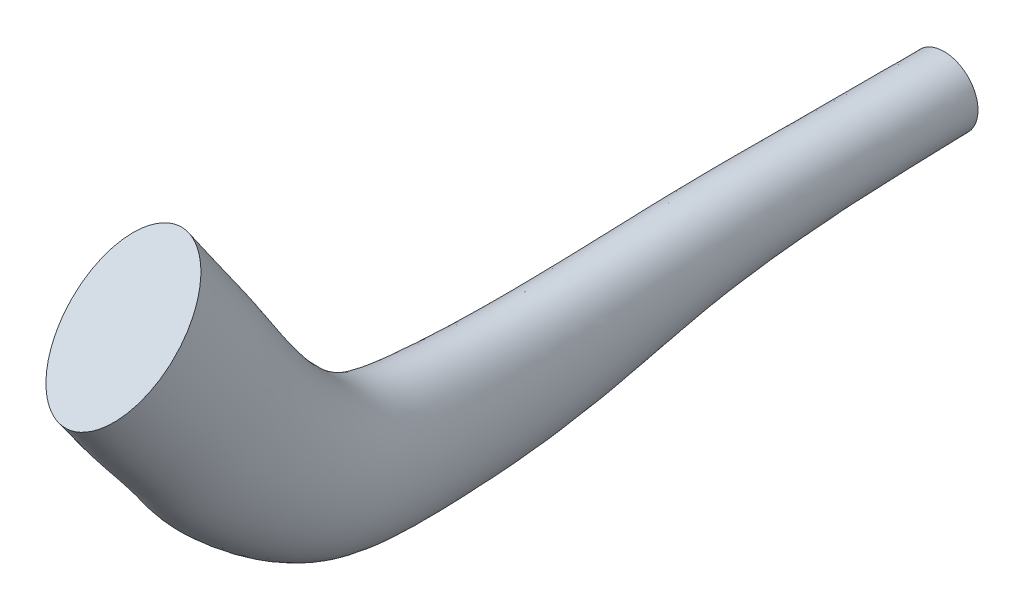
ISO-10303-21;
HEADER;
FILE_DESCRIPTION(('STEP AP214'),'2;1');
FILE_NAME('part.step','',(''),(''),'','','');
FILE_SCHEMA(('AUTOMOTIVE_DESIGN { 1 0 10303 214 1 1 1 1 }'));
ENDSEC;
DATA;
#1=APPLICATION_CONTEXT('core data for automotive mechanical design processes');
#2=APPLICATION_PROTOCOL_DEFINITION('international standard','automotive_design',2000,#1);
#3=PRODUCT_CONTEXT('',#1,'mechanical');
#4=PRODUCT('Part','Part','',(#3));
#5=PRODUCT_RELATED_PRODUCT_CATEGORY('part','',(#4));
#6=PRODUCT_DEFINITION_FORMATION('','',#4);
#7=PRODUCT_DEFINITION_CONTEXT('part definition',#1,'design');
#8=PRODUCT_DEFINITION('design','',#6,#7);
#9=PRODUCT_DEFINITION_SHAPE('','',#8);
#10=(LENGTH_UNIT() NAMED_UNIT(*) SI_UNIT(.MILLI.,.METRE.));
#11=(NAMED_UNIT(*) PLANE_ANGLE_UNIT() SI_UNIT($,.RADIAN.));
#12=(NAMED_UNIT(*) SI_UNIT($,.STERADIAN.) SOLID_ANGLE_UNIT());
#13=UNCERTAINTY_MEASURE_WITH_UNIT(LENGTH_MEASURE(1.E-05),#10,'distance_accuracy_value','');
#14=(GEOMETRIC_REPRESENTATION_CONTEXT(3) GLOBAL_UNCERTAINTY_ASSIGNED_CONTEXT((#13)) GLOBAL_UNIT_ASSIGNED_CONTEXT((#10,
#11,#12)) REPRESENTATION_CONTEXT('',''));
#15=CARTESIAN_POINT('',(0.,0.,0.));
#16=DIRECTION('',(0.,0.,1.));
#17=DIRECTION('',(1.,0.,0.));
#18=AXIS2_PLACEMENT_3D('',#15,#16,#17);
#19=CARTESIAN_POINT('',(0.,-50.,-200.));
#20=DIRECTION('',(0.,0.,-1.));
#21=DIRECTION('',(0.,1.,0.));
#22=AXIS2_PLACEMENT_3D('',#19,#20,#21);
#23=PLANE('',#22);
#24=CARTESIAN_POINT('',(0.,-50.,-200.));
#25=DIRECTION('',(0.,0.,-1.));
#26=DIRECTION('',(0.,1.,0.));
#27=AXIS2_PLACEMENT_3D('',#24,#25,#26);
#28=CIRCLE('',#27,8.26453448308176);
#29=CARTESIAN_POINT('',(0.,-41.7354655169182,-200.));
#30=VERTEX_POINT('',#29);
#31=EDGE_CURVE('E132',#30,#30,#28,.T.);
#32=ORIENTED_EDGE('',*,*,#31,.T.);
#33=EDGE_LOOP('',(#32));
#34=FACE_BOUND('',#33,.T.);
#35=ADVANCED_FACE('F123',(#34),#23,.T.);
#36=CARTESIAN_POINT('',(0.,0.,0.));
#37=DIRECTION('',(0.,-0.707106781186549,-0.707106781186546));
#38=DIRECTION('',(0.,0.707106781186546,-0.707106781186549));
#39=AXIS2_PLACEMENT_3D('',#36,#37,#38);
#40=PLANE('',#39);
#41=CARTESIAN_POINT('',(0.,0.,0.));
#42=DIRECTION('',(0.,-0.707106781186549,-0.707106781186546));
#43=DIRECTION('',(0.,0.707106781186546,-0.707106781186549));
#44=AXIS2_PLACEMENT_3D('',#41,#42,#43);
#45=ELLIPSE('',#44,20.,12.5);
#46=CARTESIAN_POINT('',(0.,14.1421356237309,-14.142135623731));
#47=VERTEX_POINT('',#46);
#48=EDGE_CURVE('E12',#47,#47,#45,.T.);
#49=ORIENTED_EDGE('',*,*,#48,.F.);
#50=EDGE_LOOP('',(#49));
#51=FACE_BOUND('',#50,.T.);
#52=ADVANCED_FACE('F125',(#51),#40,.F.);
#53=CARTESIAN_POINT('',(0.,14.1421356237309,-14.142135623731));
#54=CARTESIAN_POINT('',(0.,10.2534800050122,-16.8511989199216));
#55=CARTESIAN_POINT('',(0.,2.47616876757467,-22.2693255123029));
#56=CARTESIAN_POINT('',(0.,-11.2624308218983,-32.1356729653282));
#57=CARTESIAN_POINT('',(0.,-26.9034744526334,-41.7133951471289));
#58=CARTESIAN_POINT('',(0.,-39.7759122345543,-55.0439267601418));
#59=CARTESIAN_POINT('',(0.,-44.5209625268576,-89.7846619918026));
#60=CARTESIAN_POINT('',(0.,-41.3212849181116,-128.488213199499));
#61=CARTESIAN_POINT('',(0.,-41.798451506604,-171.552044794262));
#62=CARTESIAN_POINT('',(0.,-41.7564608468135,-190.517348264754));
#63=CARTESIAN_POINT('',(0.,-41.7354655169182,-200.));
#64=CARTESIAN_POINT('',(0.344946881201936,14.1421356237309,-14.142135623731));
#65=CARTESIAN_POINT('',(0.344640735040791,10.2534800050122,-16.8511989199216));
#66=CARTESIAN_POINT('',(0.344028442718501,2.47616876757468,-22.2693255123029));
#67=CARTESIAN_POINT('',(0.338727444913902,-11.2624308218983,-32.1356729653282));
#68=CARTESIAN_POINT('',(0.329284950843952,-26.9034744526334,-41.7133951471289));
#69=CARTESIAN_POINT('',(0.317380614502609,-39.7759122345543,-55.0439267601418));
#70=CARTESIAN_POINT('',(0.291325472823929,-44.5209625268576,-89.7846619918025));
#71=CARTESIAN_POINT('',(0.256214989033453,-41.3212849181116,-128.488213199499));
#72=CARTESIAN_POINT('',(0.231737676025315,-41.798451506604,-171.552044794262));
#73=CARTESIAN_POINT('',(0.229289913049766,-41.7564608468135,-190.517348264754));
#74=CARTESIAN_POINT('',(0.228066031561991,-41.7354655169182,-200.));
#75=CARTESIAN_POINT('',(1.02835126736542,14.1104512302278,-14.1104512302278));
#76=CARTESIAN_POINT('',(1.02743858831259,10.2218914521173,-16.8195037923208));
#77=CARTESIAN_POINT('',(1.02561323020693,2.44477189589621,-22.2376089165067));
#78=CARTESIAN_POINT('',(1.00980996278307,-11.2938263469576,-32.1058608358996));
#79=CARTESIAN_POINT('',(0.981660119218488,-26.928674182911,-41.6791677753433));
#80=CARTESIAN_POINT('',(0.946171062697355,-39.8139638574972,-55.0301815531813));
#81=CARTESIAN_POINT('',(0.868495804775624,-44.5544989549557,-89.804200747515));
#82=CARTESIAN_POINT('',(0.763824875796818,-41.3460156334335,-128.4853079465));
#83=CARTESIAN_POINT('',(0.690853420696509,-41.8178113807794,-171.55248660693));
#84=CARTESIAN_POINT('',(0.683556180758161,-41.7752581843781,-190.517495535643));
#85=CARTESIAN_POINT('',(0.679907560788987,-41.7539815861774,-200.));
#86=CARTESIAN_POINT('',(2.03076232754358,13.9715228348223,-13.9715228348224));
#87=CARTESIAN_POINT('',(2.02895999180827,10.0833832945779,-16.6805283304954));
#88=CARTESIAN_POINT('',(2.02535532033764,2.30710421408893,-22.0985393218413));
#89=CARTESIAN_POINT('',(1.99414742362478,-11.4314881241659,-31.9751418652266));
#90=CARTESIAN_POINT('',(1.93855781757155,-27.0391688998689,-41.5290890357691));
#91=CARTESIAN_POINT('',(1.86847491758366,-39.9808110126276,-54.9699121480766));
#92=CARTESIAN_POINT('',(1.71508376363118,-44.7015480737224,-89.8898734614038));
#93=CARTESIAN_POINT('',(1.50838223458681,-41.4544538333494,-128.4725691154));
#94=CARTESIAN_POINT('',(1.36428003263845,-41.902699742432,-171.554423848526));
#95=CARTESIAN_POINT('',(1.34986962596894,-41.8576799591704,-190.518141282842));
#96=CARTESIAN_POINT('',(1.34266442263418,-41.8351700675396,-200.));
#97=CARTESIAN_POINT('',(3.00725047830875,13.7448440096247,-13.7448440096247));
#98=CARTESIAN_POINT('',(3.00458149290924,9.85739013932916,-16.4537727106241));
#99=CARTESIAN_POINT('',(2.99924352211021,2.08248239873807,-21.8716301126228));
#100=CARTESIAN_POINT('',(2.95302936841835,-11.6561003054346,-31.7618577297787));
#101=CARTESIAN_POINT('',(2.8707096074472,-27.2194546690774,-41.28421704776));
#102=CARTESIAN_POINT('',(2.76692748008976,-40.2530427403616,-54.8715751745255));
#103=CARTESIAN_POINT('',(2.53977848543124,-44.9414768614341,-90.0296590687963));
#104=CARTESIAN_POINT('',(2.2336849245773,-41.6313841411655,-128.451784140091));
#105=CARTESIAN_POINT('',(2.02029145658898,-42.0412055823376,-171.557584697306));
#106=CARTESIAN_POINT('',(1.99895183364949,-41.9921612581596,-190.519194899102));
#107=CARTESIAN_POINT('',(1.98828202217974,-41.9676390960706,-200.));
#108=CARTESIAN_POINT('',(8.69127758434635,11.8801767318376,-11.8801767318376));
#109=CARTESIAN_POINT('',(8.68356392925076,7.99836320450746,-14.5884737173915));
#110=CARTESIAN_POINT('',(8.66813661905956,0.23473614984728,-20.0050676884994));
#111=CARTESIAN_POINT('',(8.53457274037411,-13.5037673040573,-30.0073755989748));
#112=CARTESIAN_POINT('',(8.29665977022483,-28.7024911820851,-39.2698922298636));
#113=CARTESIAN_POINT('',(7.99671825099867,-42.4924296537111,-54.0626520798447));
#114=CARTESIAN_POINT('',(7.34023320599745,-46.9151387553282,-91.1795399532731));
#115=CARTESIAN_POINT('',(6.4555898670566,-43.0868185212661,-128.280806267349));
#116=CARTESIAN_POINT('',(5.83885977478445,-43.1805590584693,-171.583585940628));
#117=CARTESIAN_POINT('',(5.777185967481,-43.0984087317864,-190.527861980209));
#118=CARTESIAN_POINT('',(5.74634906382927,-43.0573335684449,-200.));
#119=CARTESIAN_POINT('',(12.5,6.24420553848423,-6.24420553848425));
#120=CARTESIAN_POINT('',(12.4889060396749,2.37943999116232,-8.95059315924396));
#121=CARTESIAN_POINT('',(12.4667181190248,-5.35009110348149,-14.3633684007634));
#122=CARTESIAN_POINT('',(12.2746234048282,-19.0883550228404,-24.7044398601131));
#123=CARTESIAN_POINT('',(11.9324513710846,-33.1849804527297,-33.1815799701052));
#124=CARTESIAN_POINT('',(11.5010684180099,-49.2609938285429,-51.6176758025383));
#125=CARTESIAN_POINT('',(10.556896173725,-52.8805470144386,-94.6550637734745));
#126=CARTESIAN_POINT('',(9.28458130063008,-47.4858801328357,-127.764024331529));
#127=CARTESIAN_POINT('',(8.39758556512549,-46.6242637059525,-171.662174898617));
#128=CARTESIAN_POINT('',(8.308884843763,-46.4420502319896,-190.554058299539));
#129=CARTESIAN_POINT('',(8.26453448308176,-46.3509434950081,-200.));
#130=CARTESIAN_POINT('',(12.5,-7.80525692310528,7.80525692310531));
#131=CARTESIAN_POINT('',(12.4889060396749,-11.6275249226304,5.1036290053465));
#132=CARTESIAN_POINT('',(12.4667181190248,-19.2720609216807,-0.299626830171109));
#133=CARTESIAN_POINT('',(12.2746234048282,-33.0097277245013,-11.485174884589));
#134=CARTESIAN_POINT('',(11.9324513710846,-44.3590199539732,-18.0045125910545));
#135=CARTESIAN_POINT('',(11.5010684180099,-66.1338068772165,-45.5227897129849));
#136=CARTESIAN_POINT('',(10.556896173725,-67.7512368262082,-103.318919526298));
#137=CARTESIAN_POINT('',(9.28458130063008,-58.4519494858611,-126.475779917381));
#138=CARTESIAN_POINT('',(8.39758556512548,-55.2087999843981,-171.858083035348));
#139=CARTESIAN_POINT('',(8.308884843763,-54.7771470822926,-190.619361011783));
#140=CARTESIAN_POINT('',(8.26453448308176,-54.5613206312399,-200.));
#141=CARTESIAN_POINT('',(6.89893762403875,-14.1421356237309,14.142135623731));
#142=CARTESIAN_POINT('',(6.89281470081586,-17.9452355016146,11.4426545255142));
#143=CARTESIAN_POINT('',(6.88056885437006,-25.5514352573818,6.04369232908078));
#144=CARTESIAN_POINT('',(6.77454889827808,-39.2888327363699,-5.52274899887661));
#145=CARTESIAN_POINT('',(6.58569901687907,-49.3989660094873,-11.1590382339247));
#146=CARTESIAN_POINT('',(6.34761229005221,-73.7441314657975,-42.7737483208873));
#147=CARTESIAN_POINT('',(5.82650945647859,-74.4585224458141,-107.226670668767));
#148=CARTESIAN_POINT('',(5.12429978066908,-63.3980925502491,-125.89472931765));
#149=CARTESIAN_POINT('',(4.63475352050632,-59.0807748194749,-171.946445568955));
#150=CARTESIAN_POINT('',(4.58579826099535,-58.5366145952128,-190.648815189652));
#151=CARTESIAN_POINT('',(4.56132063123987,-58.2645344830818,-200.));
#152=CARTESIAN_POINT('',(-6.89893762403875,-14.1421356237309,14.142135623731));
#153=CARTESIAN_POINT('',(-6.89281470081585,-17.9452355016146,11.4426545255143));
#154=CARTESIAN_POINT('',(-6.88056885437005,-25.551435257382,6.04369232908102));
#155=CARTESIAN_POINT('',(-6.77454889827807,-39.2888327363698,-5.52274899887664));
#156=CARTESIAN_POINT('',(-6.58569901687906,-49.3989660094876,-11.1590382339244));
#157=CARTESIAN_POINT('',(-6.3476122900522,-73.7441314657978,-42.7737483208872));
#158=CARTESIAN_POINT('',(-5.82650945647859,-74.4585224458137,-107.226670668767));
#159=CARTESIAN_POINT('',(-5.12429978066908,-63.3980925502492,-125.89472931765));
#160=CARTESIAN_POINT('',(-4.63475352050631,-59.0807748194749,-171.946445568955));
#161=CARTESIAN_POINT('',(-4.58579826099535,-58.5366145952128,-190.648815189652));
#162=CARTESIAN_POINT('',(-4.56132063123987,-58.2645344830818,-200.));
#163=CARTESIAN_POINT('',(-12.5,-7.80525692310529,7.80525692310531));
#164=CARTESIAN_POINT('',(-12.4889060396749,-11.6275249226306,5.10362900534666));
#165=CARTESIAN_POINT('',(-12.4667181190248,-19.2720609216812,-0.299626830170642));
#166=CARTESIAN_POINT('',(-12.2746234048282,-33.0097277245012,-11.485174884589));
#167=CARTESIAN_POINT('',(-11.9324513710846,-44.3590199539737,-18.0045125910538));
#168=CARTESIAN_POINT('',(-11.5010684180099,-66.1338068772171,-45.5227897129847));
#169=CARTESIAN_POINT('',(-10.556896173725,-67.7512368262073,-103.318919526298));
#170=CARTESIAN_POINT('',(-9.28458130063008,-58.4519494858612,-126.475779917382));
#171=CARTESIAN_POINT('',(-8.39758556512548,-55.2087999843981,-171.858083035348));
#172=CARTESIAN_POINT('',(-8.308884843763,-54.7771470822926,-190.619361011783));
#173=CARTESIAN_POINT('',(-8.26453448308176,-54.5613206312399,-200.));
#174=CARTESIAN_POINT('',(-12.5,6.24420553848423,-6.24420553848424));
#175=CARTESIAN_POINT('',(-12.4889060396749,2.37943999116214,-8.95059315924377));
#176=CARTESIAN_POINT('',(-12.4667181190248,-5.35009110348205,-14.3633684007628));
#177=CARTESIAN_POINT('',(-12.2746234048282,-19.0883550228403,-24.7044398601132));
#178=CARTESIAN_POINT('',(-11.9324513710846,-33.1849804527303,-33.1815799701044));
#179=CARTESIAN_POINT('',(-11.5010684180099,-49.2609938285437,-51.6176758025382));
#180=CARTESIAN_POINT('',(-10.556896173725,-52.8805470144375,-94.6550637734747));
#181=CARTESIAN_POINT('',(-9.28458130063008,-47.4858801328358,-127.764024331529));
#182=CARTESIAN_POINT('',(-8.39758556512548,-46.6242637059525,-171.662174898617));
#183=CARTESIAN_POINT('',(-8.308884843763,-46.4420502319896,-190.554058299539));
#184=CARTESIAN_POINT('',(-8.26453448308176,-46.3509434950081,-200.));
#185=CARTESIAN_POINT('',(-8.69127758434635,11.8801767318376,-11.8801767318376));
#186=CARTESIAN_POINT('',(-8.68356392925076,7.9983632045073,-14.5884737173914));
#187=CARTESIAN_POINT('',(-8.66813661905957,0.234736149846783,-20.0050676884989));
#188=CARTESIAN_POINT('',(-8.53457274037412,-13.5037673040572,-30.0073755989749));
#189=CARTESIAN_POINT('',(-8.29665977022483,-28.7024911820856,-39.2698922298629));
#190=CARTESIAN_POINT('',(-7.99671825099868,-42.4924296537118,-54.0626520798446));
#191=CARTESIAN_POINT('',(-7.34023320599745,-46.9151387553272,-91.1795399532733));
#192=CARTESIAN_POINT('',(-6.4555898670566,-43.0868185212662,-128.280806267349));
#193=CARTESIAN_POINT('',(-5.83885977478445,-43.1805590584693,-171.583585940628));
#194=CARTESIAN_POINT('',(-5.777185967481,-43.0984087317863,-190.52786198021));
#195=CARTESIAN_POINT('',(-5.74634906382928,-43.0573335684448,-200.));
#196=CARTESIAN_POINT('',(-3.00725047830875,13.7448440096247,-13.7448440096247));
#197=CARTESIAN_POINT('',(-3.00458149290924,9.85739013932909,-16.453772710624));
#198=CARTESIAN_POINT('',(-2.99924352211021,2.08248239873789,-21.8716301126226));
#199=CARTESIAN_POINT('',(-2.95302936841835,-11.6561003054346,-31.7618577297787));
#200=CARTESIAN_POINT('',(-2.8707096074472,-27.2194546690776,-41.2842170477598));
#201=CARTESIAN_POINT('',(-2.76692748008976,-40.2530427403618,-54.8715751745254));
#202=CARTESIAN_POINT('',(-2.53977848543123,-44.9414768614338,-90.0296590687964));
#203=CARTESIAN_POINT('',(-2.2336849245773,-41.6313841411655,-128.451784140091));
#204=CARTESIAN_POINT('',(-2.02029145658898,-42.0412055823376,-171.557584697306));
#205=CARTESIAN_POINT('',(-1.99895183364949,-41.9921612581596,-190.519194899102));
#206=CARTESIAN_POINT('',(-1.98828202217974,-41.9676390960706,-200.));
#207=CARTESIAN_POINT('',(-2.03076232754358,13.9715228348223,-13.9715228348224));
#208=CARTESIAN_POINT('',(-2.02895999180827,10.0833832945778,-16.6805283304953));
#209=CARTESIAN_POINT('',(-2.02535532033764,2.30710421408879,-22.0985393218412));
#210=CARTESIAN_POINT('',(-1.99414742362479,-11.4314881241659,-31.9751418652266));
#211=CARTESIAN_POINT('',(-1.93855781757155,-27.0391688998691,-41.5290890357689));
#212=CARTESIAN_POINT('',(-1.86847491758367,-39.9808110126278,-54.9699121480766));
#213=CARTESIAN_POINT('',(-1.71508376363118,-44.7015480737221,-89.8898734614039));
#214=CARTESIAN_POINT('',(-1.50838223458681,-41.4544538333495,-128.4725691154));
#215=CARTESIAN_POINT('',(-1.36428003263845,-41.902699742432,-171.554423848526));
#216=CARTESIAN_POINT('',(-1.34986962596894,-41.8576799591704,-190.518141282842));
#217=CARTESIAN_POINT('',(-1.34266442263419,-41.8351700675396,-200.));
#218=CARTESIAN_POINT('',(-1.02835126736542,14.1104512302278,-14.1104512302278));
#219=CARTESIAN_POINT('',(-1.02743858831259,10.2218914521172,-16.8195037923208));
#220=CARTESIAN_POINT('',(-1.02561323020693,2.44477189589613,-22.2376089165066));
#221=CARTESIAN_POINT('',(-1.00980996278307,-11.2938263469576,-32.1058608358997));
#222=CARTESIAN_POINT('',(-0.981660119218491,-26.928674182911,-41.6791677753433));
#223=CARTESIAN_POINT('',(-0.946171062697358,-39.8139638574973,-55.0301815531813));
#224=CARTESIAN_POINT('',(-0.868495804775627,-44.5544989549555,-89.804200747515));
#225=CARTESIAN_POINT('',(-0.763824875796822,-41.3460156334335,-128.4853079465));
#226=CARTESIAN_POINT('',(-0.69085342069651,-41.8178113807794,-171.55248660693));
#227=CARTESIAN_POINT('',(-0.683556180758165,-41.7752581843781,-190.517495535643));
#228=CARTESIAN_POINT('',(-0.679907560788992,-41.7539815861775,-200.));
#229=CARTESIAN_POINT('',(-0.344946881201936,14.1421356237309,-14.142135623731));
#230=CARTESIAN_POINT('',(-0.344640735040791,10.2534800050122,-16.8511989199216));
#231=CARTESIAN_POINT('',(-0.344028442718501,2.47616876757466,-22.2693255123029));
#232=CARTESIAN_POINT('',(-0.338727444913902,-11.2624308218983,-32.1356729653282));
#233=CARTESIAN_POINT('',(-0.329284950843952,-26.9034744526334,-41.7133951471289));
#234=CARTESIAN_POINT('',(-0.317380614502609,-39.7759122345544,-55.0439267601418));
#235=CARTESIAN_POINT('',(-0.291325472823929,-44.5209625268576,-89.7846619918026));
#236=CARTESIAN_POINT('',(-0.256214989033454,-41.3212849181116,-128.488213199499));
#237=CARTESIAN_POINT('',(-0.231737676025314,-41.798451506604,-171.552044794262));
#238=CARTESIAN_POINT('',(-0.229289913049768,-41.7564608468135,-190.517348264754));
#239=CARTESIAN_POINT('',(-0.228066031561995,-41.7354655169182,-200.));
#240=CARTESIAN_POINT('',(0.,14.1421356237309,-14.142135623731));
#241=CARTESIAN_POINT('',(0.,10.2534800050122,-16.8511989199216));
#242=CARTESIAN_POINT('',(0.,2.47616876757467,-22.2693255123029));
#243=CARTESIAN_POINT('',(0.,-11.2624308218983,-32.1356729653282));
#244=CARTESIAN_POINT('',(0.,-26.9034744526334,-41.7133951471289));
#245=CARTESIAN_POINT('',(0.,-39.7759122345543,-55.0439267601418));
#246=CARTESIAN_POINT('',(0.,-44.5209625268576,-89.7846619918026));
#247=CARTESIAN_POINT('',(0.,-41.3212849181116,-128.488213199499));
#248=CARTESIAN_POINT('',(0.,-41.798451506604,-171.552044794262));
#249=CARTESIAN_POINT('',(0.,-41.7564608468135,-190.517348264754));
#250=CARTESIAN_POINT('',(0.,-41.7354655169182,-200.));
#251=B_SPLINE_SURFACE_WITH_KNOTS('',3,3,((#53,#54,#55,#56,#57,#58,#59,#60,#61,#62,#63),(#64,#65,
#66,#67,#68,#69,#70,#71,#72,#73,#74),(#75,#76,#77,#78,#79,#80,#81,#82,#83,#84,#85),(#86,#87,#88,
#89,#90,#91,#92,#93,#94,#95,#96),(#97,#98,#99,#100,#101,#102,#103,#104,#105,#106,#107),(#108,
#109,#110,#111,#112,#113,#114,#115,#116,#117,#118),(#119,#120,#121,#122,#123,#124,#125,#126,
#127,#128,#129),(#130,#131,#132,#133,#134,#135,#136,#137,#138,#139,#140),(#141,#142,#143,#144,
#145,#146,#147,#148,#149,#150,#151),(#152,#153,#154,#155,#156,#157,#158,#159,#160,#161,#162),
(#163,#164,#165,#166,#167,#168,#169,#170,#171,#172,#173),(#174,#175,#176,#177,#178,#179,#180,
#181,#182,#183,#184),(#185,#186,#187,#188,#189,#190,#191,#192,#193,#194,#195),(#196,#197,#198,
#199,#200,#201,#202,#203,#204,#205,#206),(#207,#208,#209,#210,#211,#212,#213,#214,#215,#216,
#217),(#218,#219,#220,#221,#222,#223,#224,#225,#226,#227,#228),(#229,#230,#231,#232,#233,#234,
#235,#236,#237,#238,#239),(#240,#241,#242,#243,#244,#245,#246,#247,#248,#249,#250)),
.UNSPECIFIED.,.T.,.F.,.F.,(4,1,1,1,1,2,2,2,1,1,1,1,4),(4,1,1,1,1,1,1,1,4),(0.,0.0125,
0.0249999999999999,0.0375000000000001,0.05,0.25,0.5,0.75,0.95,0.9625,0.975,0.9875,1.),(0.,
0.0667875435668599,0.13357508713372,0.238526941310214,0.323956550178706,0.392590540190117,
0.732739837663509,0.866369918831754,1.),.UNSPECIFIED.);
#252=ORIENTED_EDGE('',*,*,#48,.T.);
#253=EDGE_LOOP('',(#252));
#254=FACE_BOUND('',#253,.T.);
#255=ORIENTED_EDGE('',*,*,#31,.F.);
#256=EDGE_LOOP('',(#255));
#257=FACE_BOUND('',#256,.T.);
#258=ADVANCED_FACE('F158',(#254,#257),#251,.T.);
#259=CLOSED_SHELL('',(#35,#52,#258));
#260=MANIFOLD_SOLID_BREP('B2',#259);
#261=ADVANCED_BREP_SHAPE_REPRESENTATION('',(#18,#260),#14);
#262=SHAPE_DEFINITION_REPRESENTATION(#9,#261);
ENDSEC;
END-ISO-10303-21;
